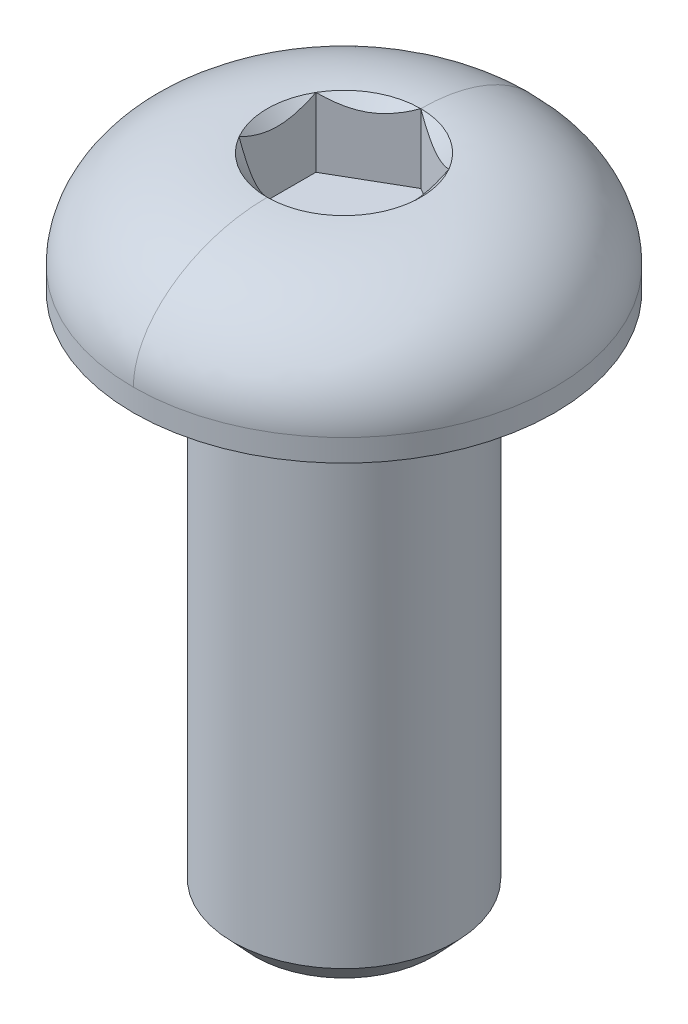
ISO-10303-21;
HEADER;
FILE_DESCRIPTION(('STEP AP214'),'2;1');
FILE_NAME('part.step','',(''),(''),'','','');
FILE_SCHEMA(('AUTOMOTIVE_DESIGN { 1 0 10303 214 1 1 1 1 }'));
ENDSEC;
DATA;
#1=APPLICATION_CONTEXT('core data for automotive mechanical design processes');
#2=APPLICATION_PROTOCOL_DEFINITION('international standard','automotive_design',2000,#1);
#3=PRODUCT_CONTEXT('',#1,'mechanical');
#4=PRODUCT('Part','Part','',(#3));
#5=PRODUCT_RELATED_PRODUCT_CATEGORY('part','',(#4));
#6=PRODUCT_DEFINITION_FORMATION('','',#4);
#7=PRODUCT_DEFINITION_CONTEXT('part definition',#1,'design');
#8=PRODUCT_DEFINITION('design','',#6,#7);
#9=PRODUCT_DEFINITION_SHAPE('','',#8);
#10=(LENGTH_UNIT() NAMED_UNIT(*) SI_UNIT(.MILLI.,.METRE.));
#11=(NAMED_UNIT(*) PLANE_ANGLE_UNIT() SI_UNIT($,.RADIAN.));
#12=(NAMED_UNIT(*) SI_UNIT($,.STERADIAN.) SOLID_ANGLE_UNIT());
#13=UNCERTAINTY_MEASURE_WITH_UNIT(LENGTH_MEASURE(1.E-05),#10,'distance_accuracy_value','');
#14=(GEOMETRIC_REPRESENTATION_CONTEXT(3) GLOBAL_UNCERTAINTY_ASSIGNED_CONTEXT((#13)) GLOBAL_UNIT_ASSIGNED_CONTEXT((#10,
#11,#12)) REPRESENTATION_CONTEXT('',''));
#15=CARTESIAN_POINT('',(0.,0.,0.));
#16=DIRECTION('',(0.,0.,1.));
#17=DIRECTION('',(1.,0.,0.));
#18=AXIS2_PLACEMENT_3D('',#15,#16,#17);
#19=CARTESIAN_POINT('',(0.,1.14,-1.73205080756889));
#20=DIRECTION('',(0.,1.,0.));
#21=DIRECTION('',(-1.,0.,0.));
#22=AXIS2_PLACEMENT_3D('',#19,#20,#21);
#23=PLANE('',#22);
#24=DIRECTION('',(0.866025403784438,0.,-0.500000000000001));
#25=VECTOR('',#24,1.);
#26=CARTESIAN_POINT('',(0.,1.14,1.73205080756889));
#27=LINE('',#26,#25);
#28=CARTESIAN_POINT('',(0.,1.14,1.73205080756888));
#29=VERTEX_POINT('',#28);
#30=CARTESIAN_POINT('',(1.5,1.14,0.866025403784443));
#31=VERTEX_POINT('',#30);
#32=EDGE_CURVE('E84',#29,#31,#27,.T.);
#33=ORIENTED_EDGE('',*,*,#32,.T.);
#34=DIRECTION('',(0.,0.,-1.));
#35=VECTOR('',#34,1.);
#36=CARTESIAN_POINT('',(1.5,1.14,0.866025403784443));
#37=LINE('',#36,#35);
#38=CARTESIAN_POINT('',(1.5,1.14,-0.866025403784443));
#39=VERTEX_POINT('',#38);
#40=EDGE_CURVE('E174',#31,#39,#37,.T.);
#41=ORIENTED_EDGE('',*,*,#40,.T.);
#42=DIRECTION('',(-0.866025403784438,0.,-0.500000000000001));
#43=VECTOR('',#42,1.);
#44=CARTESIAN_POINT('',(1.5,1.14,-0.866025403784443));
#45=LINE('',#44,#43);
#46=CARTESIAN_POINT('',(0.,1.14,-1.73205080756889));
#47=VERTEX_POINT('',#46);
#48=EDGE_CURVE('E169',#39,#47,#45,.T.);
#49=ORIENTED_EDGE('',*,*,#48,.T.);
#50=DIRECTION('',(-0.866025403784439,0.,0.5));
#51=VECTOR('',#50,1.);
#52=CARTESIAN_POINT('',(0.,1.14,-1.73205080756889));
#53=LINE('',#52,#51);
#54=CARTESIAN_POINT('',(-1.5,1.14,-0.866025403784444));
#55=VERTEX_POINT('',#54);
#56=EDGE_CURVE('E163',#47,#55,#53,.T.);
#57=ORIENTED_EDGE('',*,*,#56,.T.);
#58=DIRECTION('',(0.,0.,1.));
#59=VECTOR('',#58,1.);
#60=CARTESIAN_POINT('',(-1.5,1.14,-0.866025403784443));
#61=LINE('',#60,#59);
#62=CARTESIAN_POINT('',(-1.5,1.14,0.866025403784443));
#63=VERTEX_POINT('',#62);
#64=EDGE_CURVE('E157',#55,#63,#61,.T.);
#65=ORIENTED_EDGE('',*,*,#64,.T.);
#66=DIRECTION('',(0.866025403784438,0.,0.500000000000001));
#67=VECTOR('',#66,1.);
#68=CARTESIAN_POINT('',(-1.5,1.14,0.866025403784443));
#69=LINE('',#68,#67);
#70=EDGE_CURVE('E88',#63,#29,#69,.T.);
#71=ORIENTED_EDGE('',*,*,#70,.T.);
#72=EDGE_LOOP('',(#33,#41,#49,#57,#65,#71));
#73=FACE_BOUND('',#72,.T.);
#74=ADVANCED_FACE('F17',(#73),#23,.T.);
#75=CARTESIAN_POINT('',(0.,1.14,1.73205080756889));
#76=DIRECTION('',(0.500000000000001,0.,0.866025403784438));
#77=DIRECTION('',(0.866025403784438,0.,-0.500000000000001));
#78=AXIS2_PLACEMENT_3D('',#75,#76,#77);
#79=PLANE('',#78);
#80=CARTESIAN_POINT('',(4.40269606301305E-12,2.70000000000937,1.73205080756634));
#81=CARTESIAN_POINT('',(0.05155573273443,2.67026284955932,1.70228509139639));
#82=CARTESIAN_POINT('',(0.103973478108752,2.64227250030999,1.67202169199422));
#83=CARTESIAN_POINT('',(0.210858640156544,2.59102336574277,1.61031151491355));
#84=CARTESIAN_POINT('',(0.265336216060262,2.56779308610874,1.57885887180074));
#85=CARTESIAN_POINT('',(0.375187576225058,2.52799946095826,1.51543615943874));
#86=CARTESIAN_POINT('',(0.430533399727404,2.51133612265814,1.48348223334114));
#87=CARTESIAN_POINT('',(0.542443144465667,2.48566307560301,1.41887111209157));
#88=CARTESIAN_POINT('',(0.599003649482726,2.47663421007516,1.38621588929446));
#89=CARTESIAN_POINT('',(0.696490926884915,2.46848741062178,1.32993158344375));
#90=CARTESIAN_POINT('',(0.737291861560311,2.46728188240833,1.30637515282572));
#91=CARTESIAN_POINT('',(0.818821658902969,2.46931613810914,1.25930390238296));
#92=CARTESIAN_POINT('',(0.859550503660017,2.47255690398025,1.2357890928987));
#93=CARTESIAN_POINT('',(0.94061593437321,2.48329730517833,1.18898594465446));
#94=CARTESIAN_POINT('',(0.980952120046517,2.49080090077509,1.16569783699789));
#95=CARTESIAN_POINT('',(1.06094744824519,2.50965947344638,1.11951251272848));
#96=CARTESIAN_POINT('',(1.10060629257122,2.52101610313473,1.09661546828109));
#97=CARTESIAN_POINT('',(1.20214986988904,2.55471858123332,1.03798925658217));
#98=CARTESIAN_POINT('',(1.26340587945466,2.57960098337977,1.00262308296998));
#99=CARTESIAN_POINT('',(1.35347611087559,2.62160373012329,0.950621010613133));
#100=CARTESIAN_POINT('',(1.38315704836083,2.63636065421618,0.933484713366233));
#101=CARTESIAN_POINT('',(1.44197336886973,2.66722152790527,0.899527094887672));
#102=CARTESIAN_POINT('',(1.47110900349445,2.6833248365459,0.882705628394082));
#103=CARTESIAN_POINT('',(1.49999999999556,2.70000000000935,0.866025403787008));
#104=B_SPLINE_CURVE_WITH_KNOTS('',3,(#80,#81,#82,#83,#84,#85,#86,#87,#88,#89,#90,#91,#92,#93,
#94,#95,#96,#97,#98,#99,#100,#101,#102,#103),.UNSPECIFIED.,.F.,.F.,(4,2,2,2,2,2,2,2,2,2,2,4),
(0.,0.199774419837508,0.400712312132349,0.598459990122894,0.795709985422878,0.936894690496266,
1.07811058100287,1.2194578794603,1.3608658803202,1.58533909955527,1.69726364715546,
1.80913521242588),.UNSPECIFIED.);
#105=CARTESIAN_POINT('',(0.,2.70000000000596,1.73205080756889));
#106=VERTEX_POINT('',#105);
#107=CARTESIAN_POINT('',(1.5,2.70000000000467,0.86602540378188));
#108=VERTEX_POINT('',#107);
#109=EDGE_CURVE('E20',#106,#108,#104,.T.);
#110=ORIENTED_EDGE('',*,*,#109,.T.);
#111=DIRECTION('',(0.,1.,0.));
#112=VECTOR('',#111,1.);
#113=CARTESIAN_POINT('',(1.5,1.14,0.866025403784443));
#114=LINE('',#113,#112);
#115=EDGE_CURVE('E172',#108,#31,#114,.F.);
#116=ORIENTED_EDGE('',*,*,#115,.T.);
#117=ORIENTED_EDGE('',*,*,#32,.F.);
#118=DIRECTION('',(0.,1.,0.));
#119=VECTOR('',#118,1.);
#120=CARTESIAN_POINT('',(0.,1.14,1.73205080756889));
#121=LINE('',#120,#119);
#122=EDGE_CURVE('E78',#29,#106,#121,.T.);
#123=ORIENTED_EDGE('',*,*,#122,.T.);
#124=EDGE_LOOP('',(#110,#116,#117,#123));
#125=FACE_BOUND('',#124,.T.);
#126=ADVANCED_FACE('F80',(#125),#79,.F.);
#127=CARTESIAN_POINT('',(1.5,1.14,0.866025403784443));
#128=DIRECTION('',(1.,0.,0.));
#129=DIRECTION('',(0.,0.,-1.));
#130=AXIS2_PLACEMENT_3D('',#127,#128,#129);
#131=PLANE('',#130);
#132=CARTESIAN_POINT('',(1.5,2.70000000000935,0.866025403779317));
#133=CARTESIAN_POINT('',(1.5,2.67026284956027,0.806493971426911));
#134=CARTESIAN_POINT('',(1.5,2.64227250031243,0.745967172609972));
#135=CARTESIAN_POINT('',(1.5,2.59102336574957,0.622546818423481));
#136=CARTESIAN_POINT('',(1.5,2.56779308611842,0.559641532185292));
#137=CARTESIAN_POINT('',(1.5,2.52799946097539,0.432796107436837));
#138=CARTESIAN_POINT('',(1.5,2.5113361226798,0.368888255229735));
#139=CARTESIAN_POINT('',(1.5,2.4856630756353,0.239666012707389));
#140=CARTESIAN_POINT('',(1.5,2.47663421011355,0.174355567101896));
#141=CARTESIAN_POINT('',(1.5,2.46848741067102,0.0617869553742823));
#142=CARTESIAN_POINT('',(1.5,2.46728188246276,0.0146740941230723));
#143=CARTESIAN_POINT('',(1.5,2.46931613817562,-0.079468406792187));
#144=CARTESIAN_POINT('',(1.5,2.4725569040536,-0.126498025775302));
#145=CARTESIAN_POINT('',(1.5,2.48329730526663,-0.220104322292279));
#146=CARTESIAN_POINT('',(1.5,2.49080090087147,-0.266680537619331));
#147=CARTESIAN_POINT('',(1.5,2.50965947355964,-0.359051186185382));
#148=CARTESIAN_POINT('',(1.5,2.52101610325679,-0.404845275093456));
#149=CARTESIAN_POINT('',(1.5,2.55471858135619,-0.522097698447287));
#150=CARTESIAN_POINT('',(1.5,2.57960098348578,-0.59283004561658));
#151=CARTESIAN_POINT('',(1.5,2.62160373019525,-0.696834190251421));
#152=CARTESIAN_POINT('',(1.5,2.6363606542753,-0.731106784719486));
#153=CARTESIAN_POINT('',(1.5,2.66722152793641,-0.799022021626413));
#154=CARTESIAN_POINT('',(1.5,2.68332483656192,-0.83266495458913));
#155=CARTESIAN_POINT('',(1.5,2.70000000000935,-0.866025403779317));
#156=B_SPLINE_CURVE_WITH_KNOTS('',3,(#132,#133,#134,#135,#136,#137,#138,#139,#140,#141,#142,
#143,#144,#145,#146,#147,#148,#149,#150,#151,#152,#153,#154,#155),.UNSPECIFIED.,.F.,.F.,(4,2,2,
2,2,2,2,2,2,2,2,4),(0.,0.199774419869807,0.400712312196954,0.598459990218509,0.795709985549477,
0.936894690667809,1.07811058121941,1.21945787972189,1.36086588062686,1.58533909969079,
1.69726364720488,1.80913521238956),.UNSPECIFIED.);
#157=CARTESIAN_POINT('',(1.49999999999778,2.70000000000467,-0.866025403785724));
#158=VERTEX_POINT('',#157);
#159=EDGE_CURVE('E107',#108,#158,#156,.T.);
#160=ORIENTED_EDGE('',*,*,#159,.T.);
#161=DIRECTION('',(0.,1.,0.));
#162=VECTOR('',#161,1.);
#163=CARTESIAN_POINT('',(1.5,1.14,-0.866025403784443));
#164=LINE('',#163,#162);
#165=EDGE_CURVE('E166',#158,#39,#164,.F.);
#166=ORIENTED_EDGE('',*,*,#165,.T.);
#167=ORIENTED_EDGE('',*,*,#40,.F.);
#168=ORIENTED_EDGE('',*,*,#115,.F.);
#169=EDGE_LOOP('',(#160,#166,#167,#168));
#170=FACE_BOUND('',#169,.T.);
#171=ADVANCED_FACE('F253',(#170),#131,.F.);
#172=CARTESIAN_POINT('',(1.5,1.14,-0.866025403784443));
#173=DIRECTION('',(0.500000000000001,0.,-0.866025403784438));
#174=DIRECTION('',(-0.866025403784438,0.,-0.500000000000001));
#175=AXIS2_PLACEMENT_3D('',#172,#173,#174);
#176=PLANE('',#175);
#177=CARTESIAN_POINT('',(1.49999999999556,2.70000000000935,-0.866025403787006));
#178=CARTESIAN_POINT('',(1.44844426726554,2.6702628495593,-0.895791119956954));
#179=CARTESIAN_POINT('',(1.39602652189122,2.64227250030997,-0.926054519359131));
#180=CARTESIAN_POINT('',(1.28914135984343,2.59102336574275,-0.987764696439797));
#181=CARTESIAN_POINT('',(1.23466378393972,2.56779308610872,-1.01921733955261));
#182=CARTESIAN_POINT('',(1.12481242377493,2.52799946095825,-1.08264005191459));
#183=CARTESIAN_POINT('',(1.06946660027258,2.51133612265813,-1.11459397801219));
#184=CARTESIAN_POINT('',(0.957556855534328,2.48566307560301,-1.17920509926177));
#185=CARTESIAN_POINT('',(0.900996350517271,2.47663421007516,-1.21186032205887));
#186=CARTESIAN_POINT('',(0.803509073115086,2.46848741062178,-1.26814462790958));
#187=CARTESIAN_POINT('',(0.762708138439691,2.46728188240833,-1.29170105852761));
#188=CARTESIAN_POINT('',(0.681178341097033,2.46931613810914,-1.33877230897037));
#189=CARTESIAN_POINT('',(0.640449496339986,2.47255690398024,-1.36228711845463));
#190=CARTESIAN_POINT('',(0.559384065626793,2.48329730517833,-1.40909026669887));
#191=CARTESIAN_POINT('',(0.519047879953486,2.49080090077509,-1.43237837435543));
#192=CARTESIAN_POINT('',(0.439052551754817,2.50965947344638,-1.47856369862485));
#193=CARTESIAN_POINT('',(0.399393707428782,2.52101610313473,-1.50146074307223));
#194=CARTESIAN_POINT('',(0.297850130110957,2.55471858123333,-1.56008695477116));
#195=CARTESIAN_POINT('',(0.23659412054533,2.57960098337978,-1.59545312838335));
#196=CARTESIAN_POINT('',(0.146523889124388,2.6216037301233,-1.64745520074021));
#197=CARTESIAN_POINT('',(0.116842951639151,2.63636065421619,-1.66459149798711));
#198=CARTESIAN_POINT('',(0.0580266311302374,2.66722152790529,-1.69854911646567));
#199=CARTESIAN_POINT('',(0.0288909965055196,2.68332483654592,-1.71537058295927));
#200=CARTESIAN_POINT('',(4.40240045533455E-12,2.70000000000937,-1.73205080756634));
#201=B_SPLINE_CURVE_WITH_KNOTS('',3,(#177,#178,#179,#180,#181,#182,#183,#184,#185,#186,#187,
#188,#189,#190,#191,#192,#193,#194,#195,#196,#197,#198,#199,#200),.UNSPECIFIED.,.F.,.F.,(4,2,2,
2,2,2,2,2,2,2,2,4),(0.,0.199774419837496,0.400712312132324,0.598459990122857,0.79570998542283,
0.936894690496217,1.07811058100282,1.21945787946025,1.36086588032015,1.58533909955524,
1.69726364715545,1.80913521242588),.UNSPECIFIED.);
#202=CARTESIAN_POINT('',(0.,2.70000000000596,-1.73205080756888));
#203=VERTEX_POINT('',#202);
#204=EDGE_CURVE('E238',#158,#203,#201,.T.);
#205=ORIENTED_EDGE('',*,*,#204,.T.);
#206=DIRECTION('',(0.,1.,0.));
#207=VECTOR('',#206,1.);
#208=CARTESIAN_POINT('',(0.,1.14,-1.73205080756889));
#209=LINE('',#208,#207);
#210=EDGE_CURVE('E160',#203,#47,#209,.F.);
#211=ORIENTED_EDGE('',*,*,#210,.T.);
#212=ORIENTED_EDGE('',*,*,#48,.F.);
#213=ORIENTED_EDGE('',*,*,#165,.F.);
#214=EDGE_LOOP('',(#205,#211,#212,#213));
#215=FACE_BOUND('',#214,.T.);
#216=ADVANCED_FACE('F247',(#215),#176,.F.);
#217=CARTESIAN_POINT('',(0.,1.14,-1.73205080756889));
#218=DIRECTION('',(-0.5,0.,-0.866025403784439));
#219=DIRECTION('',(-0.866025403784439,0.,0.5));
#220=AXIS2_PLACEMENT_3D('',#217,#218,#219);
#221=PLANE('',#220);
#222=CARTESIAN_POINT('',(-4.40203525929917E-12,2.70000000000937,-1.73205080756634));
#223=CARTESIAN_POINT('',(-0.0515557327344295,2.67026284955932,-1.70228509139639));
#224=CARTESIAN_POINT('',(-0.103973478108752,2.64227250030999,-1.67202169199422));
#225=CARTESIAN_POINT('',(-0.210858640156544,2.59102336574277,-1.61031151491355));
#226=CARTESIAN_POINT('',(-0.265336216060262,2.56779308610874,-1.57885887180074));
#227=CARTESIAN_POINT('',(-0.375187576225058,2.52799946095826,-1.51543615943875));
#228=CARTESIAN_POINT('',(-0.430533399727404,2.51133612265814,-1.48348223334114));
#229=CARTESIAN_POINT('',(-0.542443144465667,2.48566307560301,-1.41887111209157));
#230=CARTESIAN_POINT('',(-0.599003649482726,2.47663421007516,-1.38621588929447));
#231=CARTESIAN_POINT('',(-0.696490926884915,2.46848741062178,-1.32993158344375));
#232=CARTESIAN_POINT('',(-0.737291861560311,2.46728188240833,-1.30637515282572));
#233=CARTESIAN_POINT('',(-0.818821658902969,2.46931613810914,-1.25930390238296));
#234=CARTESIAN_POINT('',(-0.859550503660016,2.47255690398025,-1.2357890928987));
#235=CARTESIAN_POINT('',(-0.94061593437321,2.48329730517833,-1.18898594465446));
#236=CARTESIAN_POINT('',(-0.980952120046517,2.49080090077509,-1.1656978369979));
#237=CARTESIAN_POINT('',(-1.06094744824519,2.50965947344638,-1.11951251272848));
#238=CARTESIAN_POINT('',(-1.10060629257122,2.52101610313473,-1.0966154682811));
#239=CARTESIAN_POINT('',(-1.20214986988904,2.55471858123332,-1.03798925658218));
#240=CARTESIAN_POINT('',(-1.26340587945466,2.57960098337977,-1.00262308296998));
#241=CARTESIAN_POINT('',(-1.35347611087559,2.62160373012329,-0.950621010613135));
#242=CARTESIAN_POINT('',(-1.38315704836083,2.63636065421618,-0.933484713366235));
#243=CARTESIAN_POINT('',(-1.44197336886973,2.66722152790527,-0.899527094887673));
#244=CARTESIAN_POINT('',(-1.47110900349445,2.6833248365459,-0.882705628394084));
#245=CARTESIAN_POINT('',(-1.49999999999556,2.70000000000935,-0.866025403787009));
#246=B_SPLINE_CURVE_WITH_KNOTS('',3,(#222,#223,#224,#225,#226,#227,#228,#229,#230,#231,#232,
#233,#234,#235,#236,#237,#238,#239,#240,#241,#242,#243,#244,#245),.UNSPECIFIED.,.F.,.F.,(4,2,2,
2,2,2,2,2,2,2,2,4),(0.,0.199774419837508,0.400712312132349,0.598459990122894,0.795709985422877,
0.936894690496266,1.07811058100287,1.2194578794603,1.3608658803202,1.58533909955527,
1.69726364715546,1.80913521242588),.UNSPECIFIED.);
#247=CARTESIAN_POINT('',(-1.5,2.70000000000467,-0.866025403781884));
#248=VERTEX_POINT('',#247);
#249=EDGE_CURVE('E232',#203,#248,#246,.T.);
#250=ORIENTED_EDGE('',*,*,#249,.T.);
#251=DIRECTION('',(0.,1.,0.));
#252=VECTOR('',#251,1.);
#253=CARTESIAN_POINT('',(-1.5,1.14,-0.866025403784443));
#254=LINE('',#253,#252);
#255=EDGE_CURVE('E154',#248,#55,#254,.F.);
#256=ORIENTED_EDGE('',*,*,#255,.T.);
#257=ORIENTED_EDGE('',*,*,#56,.F.);
#258=ORIENTED_EDGE('',*,*,#210,.F.);
#259=EDGE_LOOP('',(#250,#256,#257,#258));
#260=FACE_BOUND('',#259,.T.);
#261=ADVANCED_FACE('F243',(#260),#221,.F.);
#262=CARTESIAN_POINT('',(-1.5,1.14,-0.866025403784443));
#263=DIRECTION('',(-1.,0.,0.));
#264=DIRECTION('',(0.,0.,1.));
#265=AXIS2_PLACEMENT_3D('',#262,#263,#264);
#266=PLANE('',#265);
#267=CARTESIAN_POINT('',(-1.5,2.70000000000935,-0.866025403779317));
#268=CARTESIAN_POINT('',(-1.5,2.67026284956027,-0.806493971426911));
#269=CARTESIAN_POINT('',(-1.5,2.64227250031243,-0.745967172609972));
#270=CARTESIAN_POINT('',(-1.5,2.59102336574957,-0.62254681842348));
#271=CARTESIAN_POINT('',(-1.5,2.56779308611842,-0.559641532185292));
#272=CARTESIAN_POINT('',(-1.5,2.52799946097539,-0.432796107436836));
#273=CARTESIAN_POINT('',(-1.5,2.5113361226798,-0.368888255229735));
#274=CARTESIAN_POINT('',(-1.5,2.4856630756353,-0.239666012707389));
#275=CARTESIAN_POINT('',(-1.5,2.47663421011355,-0.174355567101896));
#276=CARTESIAN_POINT('',(-1.5,2.46848741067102,-0.0617869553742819));
#277=CARTESIAN_POINT('',(-1.5,2.46728188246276,-0.0146740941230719));
#278=CARTESIAN_POINT('',(-1.5,2.46931613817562,0.0794684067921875));
#279=CARTESIAN_POINT('',(-1.5,2.4725569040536,0.126498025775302));
#280=CARTESIAN_POINT('',(-1.5,2.48329730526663,0.220104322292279));
#281=CARTESIAN_POINT('',(-1.5,2.49080090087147,0.266680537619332));
#282=CARTESIAN_POINT('',(-1.5,2.50965947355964,0.359051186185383));
#283=CARTESIAN_POINT('',(-1.5,2.52101610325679,0.404845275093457));
#284=CARTESIAN_POINT('',(-1.5,2.55471858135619,0.522097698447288));
#285=CARTESIAN_POINT('',(-1.5,2.57960098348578,0.59283004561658));
#286=CARTESIAN_POINT('',(-1.5,2.62160373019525,0.696834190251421));
#287=CARTESIAN_POINT('',(-1.5,2.6363606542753,0.731106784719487));
#288=CARTESIAN_POINT('',(-1.5,2.66722152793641,0.799022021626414));
#289=CARTESIAN_POINT('',(-1.5,2.68332483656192,0.83266495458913));
#290=CARTESIAN_POINT('',(-1.5,2.70000000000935,0.866025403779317));
#291=B_SPLINE_CURVE_WITH_KNOTS('',3,(#267,#268,#269,#270,#271,#272,#273,#274,#275,#276,#277,
#278,#279,#280,#281,#282,#283,#284,#285,#286,#287,#288,#289,#290),.UNSPECIFIED.,.F.,.F.,(4,2,2,
2,2,2,2,2,2,2,2,4),(0.,0.199774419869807,0.400712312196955,0.59845999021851,0.795709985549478,
0.93689469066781,1.07811058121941,1.2194578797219,1.36086588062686,1.58533909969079,
1.69726364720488,1.80913521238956),.UNSPECIFIED.);
#292=CARTESIAN_POINT('',(-1.49999999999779,2.70000000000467,0.866025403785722));
#293=VERTEX_POINT('',#292);
#294=EDGE_CURVE('E100',#248,#293,#291,.T.);
#295=ORIENTED_EDGE('',*,*,#294,.T.);
#296=DIRECTION('',(0.,1.,0.));
#297=VECTOR('',#296,1.);
#298=CARTESIAN_POINT('',(-1.5,1.14,0.866025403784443));
#299=LINE('',#298,#297);
#300=EDGE_CURVE('E87',#293,#63,#299,.F.);
#301=ORIENTED_EDGE('',*,*,#300,.T.);
#302=ORIENTED_EDGE('',*,*,#64,.F.);
#303=ORIENTED_EDGE('',*,*,#255,.F.);
#304=EDGE_LOOP('',(#295,#301,#302,#303));
#305=FACE_BOUND('',#304,.T.);
#306=ADVANCED_FACE('F246',(#305),#266,.F.);
#307=CARTESIAN_POINT('',(-1.5,1.14,0.866025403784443));
#308=DIRECTION('',(-0.500000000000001,0.,0.866025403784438));
#309=DIRECTION('',(0.866025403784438,0.,0.500000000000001));
#310=AXIS2_PLACEMENT_3D('',#307,#308,#309);
#311=PLANE('',#310);
#312=CARTESIAN_POINT('',(-1.49999999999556,2.70000000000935,0.866025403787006));
#313=CARTESIAN_POINT('',(-1.44844426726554,2.6702628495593,0.895791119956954));
#314=CARTESIAN_POINT('',(-1.39602652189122,2.64227250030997,0.926054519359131));
#315=CARTESIAN_POINT('',(-1.28914135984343,2.59102336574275,0.987764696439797));
#316=CARTESIAN_POINT('',(-1.23466378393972,2.56779308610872,1.01921733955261));
#317=CARTESIAN_POINT('',(-1.12481242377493,2.52799946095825,1.08264005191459));
#318=CARTESIAN_POINT('',(-1.06946660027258,2.51133612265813,1.11459397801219));
#319=CARTESIAN_POINT('',(-0.957556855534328,2.48566307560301,1.17920509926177));
#320=CARTESIAN_POINT('',(-0.900996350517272,2.47663421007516,1.21186032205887));
#321=CARTESIAN_POINT('',(-0.803509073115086,2.46848741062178,1.26814462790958));
#322=CARTESIAN_POINT('',(-0.762708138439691,2.46728188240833,1.29170105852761));
#323=CARTESIAN_POINT('',(-0.681178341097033,2.46931613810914,1.33877230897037));
#324=CARTESIAN_POINT('',(-0.640449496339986,2.47255690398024,1.36228711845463));
#325=CARTESIAN_POINT('',(-0.559384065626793,2.48329730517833,1.40909026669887));
#326=CARTESIAN_POINT('',(-0.519047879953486,2.49080090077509,1.43237837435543));
#327=CARTESIAN_POINT('',(-0.439052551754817,2.50965947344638,1.47856369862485));
#328=CARTESIAN_POINT('',(-0.399393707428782,2.52101610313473,1.50146074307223));
#329=CARTESIAN_POINT('',(-0.297850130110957,2.55471858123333,1.56008695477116));
#330=CARTESIAN_POINT('',(-0.23659412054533,2.57960098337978,1.59545312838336));
#331=CARTESIAN_POINT('',(-0.146523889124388,2.6216037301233,1.64745520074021));
#332=CARTESIAN_POINT('',(-0.116842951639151,2.63636065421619,1.66459149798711));
#333=CARTESIAN_POINT('',(-0.0580266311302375,2.66722152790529,1.69854911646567));
#334=CARTESIAN_POINT('',(-0.0288909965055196,2.68332483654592,1.71537058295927));
#335=CARTESIAN_POINT('',(-4.40227938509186E-12,2.70000000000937,1.73205080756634));
#336=B_SPLINE_CURVE_WITH_KNOTS('',3,(#312,#313,#314,#315,#316,#317,#318,#319,#320,#321,#322,
#323,#324,#325,#326,#327,#328,#329,#330,#331,#332,#333,#334,#335),.UNSPECIFIED.,.F.,.F.,(4,2,2,
2,2,2,2,2,2,2,2,4),(0.,0.199774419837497,0.400712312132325,0.598459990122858,0.79570998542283,
0.936894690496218,1.07811058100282,1.21945787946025,1.36086588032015,1.58533909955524,
1.69726364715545,1.80913521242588),.UNSPECIFIED.);
#337=EDGE_CURVE('E92',#293,#106,#336,.T.);
#338=ORIENTED_EDGE('',*,*,#337,.T.);
#339=ORIENTED_EDGE('',*,*,#122,.F.);
#340=ORIENTED_EDGE('',*,*,#70,.F.);
#341=ORIENTED_EDGE('',*,*,#300,.F.);
#342=EDGE_LOOP('',(#338,#339,#340,#341));
#343=FACE_BOUND('',#342,.T.);
#344=ADVANCED_FACE('F93',(#343),#311,.F.);
#345=CARTESIAN_POINT('',(0.,2.70000000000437,0.));
#346=DIRECTION('',(0.,1.,0.));
#347=DIRECTION('',(0.,0.,1.));
#348=AXIS2_PLACEMENT_3D('',#345,#346,#347);
#349=CONICAL_SURFACE('',#348,1.73205080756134,0.785398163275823);
#350=ORIENTED_EDGE('',*,*,#109,.F.);
#351=CARTESIAN_POINT('',(0.,2.7,0.));
#352=DIRECTION('',(0.,1.,0.));
#353=DIRECTION('',(-1.,0.,0.));
#354=AXIS2_PLACEMENT_3D('',#351,#352,#353);
#355=CIRCLE('',#354,1.73205080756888);
#356=EDGE_CURVE('E99',#106,#108,#355,.T.);
#357=ORIENTED_EDGE('',*,*,#356,.T.);
#358=EDGE_LOOP('',(#350,#357));
#359=FACE_BOUND('',#358,.T.);
#360=ADVANCED_FACE('F104',(#359),#349,.F.);
#361=CARTESIAN_POINT('',(0.,2.70000000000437,0.));
#362=DIRECTION('',(0.,1.,0.));
#363=DIRECTION('',(0.,0.,1.));
#364=AXIS2_PLACEMENT_3D('',#361,#362,#363);
#365=CONICAL_SURFACE('',#364,1.73205080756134,0.785398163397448);
#366=CARTESIAN_POINT('',(0.,2.7,0.));
#367=DIRECTION('',(0.,1.,0.));
#368=DIRECTION('',(-1.,0.,0.));
#369=AXIS2_PLACEMENT_3D('',#366,#367,#368);
#370=CIRCLE('',#369,1.73205080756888);
#371=EDGE_CURVE('E120',#108,#158,#370,.T.);
#372=ORIENTED_EDGE('',*,*,#371,.T.);
#373=ORIENTED_EDGE('',*,*,#159,.F.);
#374=EDGE_LOOP('',(#372,#373));
#375=FACE_BOUND('',#374,.T.);
#376=ADVANCED_FACE('F262',(#375),#365,.F.);
#377=CARTESIAN_POINT('',(0.,2.70000000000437,0.));
#378=DIRECTION('',(0.,1.,0.));
#379=DIRECTION('',(0.,0.,1.));
#380=AXIS2_PLACEMENT_3D('',#377,#378,#379);
#381=CONICAL_SURFACE('',#380,1.73205080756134,0.785398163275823);
#382=CARTESIAN_POINT('',(0.,2.7,0.));
#383=DIRECTION('',(0.,1.,0.));
#384=DIRECTION('',(-1.,0.,0.));
#385=AXIS2_PLACEMENT_3D('',#382,#383,#384);
#386=CIRCLE('',#385,1.73205080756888);
#387=EDGE_CURVE('E138',#158,#203,#386,.T.);
#388=ORIENTED_EDGE('',*,*,#387,.T.);
#389=ORIENTED_EDGE('',*,*,#204,.F.);
#390=EDGE_LOOP('',(#388,#389));
#391=FACE_BOUND('',#390,.T.);
#392=ADVANCED_FACE('F228',(#391),#381,.F.);
#393=CARTESIAN_POINT('',(0.,2.70000000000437,0.));
#394=DIRECTION('',(0.,1.,0.));
#395=DIRECTION('',(0.,0.,1.));
#396=AXIS2_PLACEMENT_3D('',#393,#394,#395);
#397=CONICAL_SURFACE('',#396,1.73205080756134,0.785398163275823);
#398=ORIENTED_EDGE('',*,*,#249,.F.);
#399=CARTESIAN_POINT('',(0.,2.7,0.));
#400=DIRECTION('',(0.,1.,0.));
#401=DIRECTION('',(0.,0.,1.));
#402=AXIS2_PLACEMENT_3D('',#399,#400,#401);
#403=CIRCLE('',#402,1.73205080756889);
#404=EDGE_CURVE('E144',#203,#248,#403,.T.);
#405=ORIENTED_EDGE('',*,*,#404,.T.);
#406=EDGE_LOOP('',(#398,#405));
#407=FACE_BOUND('',#406,.T.);
#408=ADVANCED_FACE('F223',(#407),#397,.F.);
#409=CARTESIAN_POINT('',(0.,2.70000000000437,0.));
#410=DIRECTION('',(0.,1.,0.));
#411=DIRECTION('',(0.,0.,1.));
#412=AXIS2_PLACEMENT_3D('',#409,#410,#411);
#413=CONICAL_SURFACE('',#412,1.73205080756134,0.785398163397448);
#414=ORIENTED_EDGE('',*,*,#294,.F.);
#415=CARTESIAN_POINT('',(0.,2.7,0.));
#416=DIRECTION('',(0.,1.,0.));
#417=DIRECTION('',(0.,0.,1.));
#418=AXIS2_PLACEMENT_3D('',#415,#416,#417);
#419=CIRCLE('',#418,1.73205080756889);
#420=EDGE_CURVE('E114',#248,#293,#419,.T.);
#421=ORIENTED_EDGE('',*,*,#420,.T.);
#422=EDGE_LOOP('',(#414,#421));
#423=FACE_BOUND('',#422,.T.);
#424=ADVANCED_FACE('F216',(#423),#413,.F.);
#425=CARTESIAN_POINT('',(0.,2.70000000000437,0.));
#426=DIRECTION('',(0.,1.,0.));
#427=DIRECTION('',(0.,0.,1.));
#428=AXIS2_PLACEMENT_3D('',#425,#426,#427);
#429=CONICAL_SURFACE('',#428,1.73205080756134,0.785398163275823);
#430=ORIENTED_EDGE('',*,*,#337,.F.);
#431=CARTESIAN_POINT('',(0.,2.7,0.));
#432=DIRECTION('',(0.,1.,0.));
#433=DIRECTION('',(0.,0.,1.));
#434=AXIS2_PLACEMENT_3D('',#431,#432,#433);
#435=CIRCLE('',#434,1.73205080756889);
#436=EDGE_CURVE('E108',#293,#106,#435,.T.);
#437=ORIENTED_EDGE('',*,*,#436,.T.);
#438=EDGE_LOOP('',(#430,#437));
#439=FACE_BOUND('',#438,.T.);
#440=ADVANCED_FACE('F109',(#439),#429,.F.);
#441=CARTESIAN_POINT('',(0.,0.5,4.75000000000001));
#442=CARTESIAN_POINT('',(9.50000000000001,0.5,4.75000000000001));
#443=CARTESIAN_POINT('',(9.50000000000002,0.500000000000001,-4.75000000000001));
#444=CARTESIAN_POINT('',(0.,0.500000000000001,-4.75000000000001));
#445=CARTESIAN_POINT('',(0.,1.78873016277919,4.75000000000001));
#446=CARTESIAN_POINT('',(9.50000000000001,1.78873016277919,4.75000000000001));
#447=CARTESIAN_POINT('',(9.50000000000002,1.78873016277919,-4.75000000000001));
#448=CARTESIAN_POINT('',(0.,1.78873016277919,-4.75000000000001));
#449=CARTESIAN_POINT('',(0.,2.7,3.4999245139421));
#450=CARTESIAN_POINT('',(6.99984902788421,2.7,3.4999245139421));
#451=CARTESIAN_POINT('',(6.99984902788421,2.7,-3.4999245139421));
#452=CARTESIAN_POINT('',(0.,2.7,-3.4999245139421));
#453=CARTESIAN_POINT('',(0.,2.7,1.73205080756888));
#454=CARTESIAN_POINT('',(3.46410161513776,2.7,1.73205080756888));
#455=CARTESIAN_POINT('',(3.46410161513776,2.7,-1.73205080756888));
#456=CARTESIAN_POINT('',(0.,2.7,-1.73205080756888));
#457=(BOUNDED_SURFACE() B_SPLINE_SURFACE(3,3,((#441,#442,#443,#444),(#445,#446,#447,#448),(#449,
#450,#451,#452),(#453,#454,#455,#456)),.UNSPECIFIED.,.F.,.F.,
.F.) B_SPLINE_SURFACE_WITH_KNOTS((4,4),(4,4),(0.,1.),(0.,1.),
.UNSPECIFIED.) GEOMETRIC_REPRESENTATION_ITEM() RATIONAL_B_SPLINE_SURFACE(((1.,0.333333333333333,
0.333333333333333,1.),(0.804737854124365,0.268245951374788,0.268245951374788,0.804737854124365),
(0.804737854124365,0.268245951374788,0.268245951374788,0.804737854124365),(1.,0.333333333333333,
0.333333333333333,1.))) REPRESENTATION_ITEM('') SURFACE());
#458=CARTESIAN_POINT('',(0.,0.500000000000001,-4.75000000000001));
#459=CARTESIAN_POINT('',(0.,1.78873016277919,-4.75000000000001));
#460=CARTESIAN_POINT('',(0.,2.7,-3.49992451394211));
#461=CARTESIAN_POINT('',(0.,2.7,-1.73205080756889));
#462=(BOUNDED_CURVE() B_SPLINE_CURVE(3,(#458,#459,#460,#461),.UNSPECIFIED.,.F.,
.F.) B_SPLINE_CURVE_WITH_KNOTS((4,4),(0.,1.),
.UNSPECIFIED.) CURVE() GEOMETRIC_REPRESENTATION_ITEM() RATIONAL_B_SPLINE_CURVE((1.,
0.804737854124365,0.804737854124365,1.)) REPRESENTATION_ITEM(''));
#463=CARTESIAN_POINT('',(0.,0.500000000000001,-4.75));
#464=VERTEX_POINT('',#463);
#465=EDGE_CURVE('E126',#464,#203,#462,.T.);
#466=CARTESIAN_POINT('',(0.,0.5,4.75000000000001));
#467=CARTESIAN_POINT('',(0.,1.78873016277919,4.75000000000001));
#468=CARTESIAN_POINT('',(0.,2.7,3.49992451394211));
#469=CARTESIAN_POINT('',(0.,2.7,1.73205080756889));
#470=(BOUNDED_CURVE() B_SPLINE_CURVE(3,(#466,#467,#468,#469),.UNSPECIFIED.,.F.,
.F.) B_SPLINE_CURVE_WITH_KNOTS((4,4),(0.,1.),
.UNSPECIFIED.) CURVE() GEOMETRIC_REPRESENTATION_ITEM() RATIONAL_B_SPLINE_CURVE((1.,
0.804737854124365,0.804737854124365,1.)) REPRESENTATION_ITEM(''));
#471=CARTESIAN_POINT('',(0.,0.5,4.75));
#472=VERTEX_POINT('',#471);
#473=EDGE_CURVE('E113',#106,#472,#470,.F.);
#474=CARTESIAN_POINT('',(0.,0.500000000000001,0.));
#475=DIRECTION('',(0.,-1.,0.));
#476=DIRECTION('',(0.,0.,-1.));
#477=AXIS2_PLACEMENT_3D('',#474,#475,#476);
#478=CIRCLE('',#477,4.75);
#479=EDGE_CURVE('E39',#464,#472,#478,.T.);
#480=ORIENTED_EDGE('',*,*,#465,.T.);
#481=ORIENTED_EDGE('',*,*,#387,.F.);
#482=ORIENTED_EDGE('',*,*,#371,.F.);
#483=ORIENTED_EDGE('',*,*,#356,.F.);
#484=ORIENTED_EDGE('',*,*,#473,.T.);
#485=ORIENTED_EDGE('',*,*,#479,.F.);
#486=EDGE_LOOP('',(#480,#481,#482,#483,#484,#485));
#487=FACE_BOUND('',#486,.T.);
#488=ADVANCED_FACE('F117',(#487),#457,.F.);
#489=CARTESIAN_POINT('',(0.,0.500000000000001,-4.75000000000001));
#490=CARTESIAN_POINT('',(-9.50000000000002,0.500000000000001,-4.75000000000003));
#491=CARTESIAN_POINT('',(-9.50000000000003,0.5,4.75));
#492=CARTESIAN_POINT('',(0.,0.5,4.75000000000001));
#493=CARTESIAN_POINT('',(0.,1.78873016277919,-4.75000000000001));
#494=CARTESIAN_POINT('',(-9.50000000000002,1.78873016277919,-4.75000000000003));
#495=CARTESIAN_POINT('',(-9.50000000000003,1.78873016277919,4.75));
#496=CARTESIAN_POINT('',(0.,1.78873016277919,4.75000000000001));
#497=CARTESIAN_POINT('',(0.,2.7,-3.49992451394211));
#498=CARTESIAN_POINT('',(-6.99984902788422,2.7,-3.49992451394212));
#499=CARTESIAN_POINT('',(-6.99984902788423,2.7,3.49992451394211));
#500=CARTESIAN_POINT('',(0.,2.7,3.49992451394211));
#501=CARTESIAN_POINT('',(0.,2.7,-1.73205080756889));
#502=CARTESIAN_POINT('',(-3.46410161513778,2.7,-1.73205080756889));
#503=CARTESIAN_POINT('',(-3.46410161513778,2.7,1.73205080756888));
#504=CARTESIAN_POINT('',(0.,2.7,1.73205080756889));
#505=(BOUNDED_SURFACE() B_SPLINE_SURFACE(3,3,((#489,#490,#491,#492),(#493,#494,#495,#496),(#497,
#498,#499,#500),(#501,#502,#503,#504)),.UNSPECIFIED.,.F.,.F.,
.F.) B_SPLINE_SURFACE_WITH_KNOTS((4,4),(4,4),(0.,1.),(0.,1.),
.UNSPECIFIED.) GEOMETRIC_REPRESENTATION_ITEM() RATIONAL_B_SPLINE_SURFACE(((1.,0.333333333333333,
0.333333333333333,1.),(0.804737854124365,0.268245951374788,0.268245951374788,0.804737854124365),
(0.804737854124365,0.268245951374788,0.268245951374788,0.804737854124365),(1.,0.333333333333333,
0.333333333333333,1.))) REPRESENTATION_ITEM('') SURFACE());
#506=CARTESIAN_POINT('',(0.,0.5,0.));
#507=DIRECTION('',(0.,-1.,0.));
#508=DIRECTION('',(0.,0.,-1.));
#509=AXIS2_PLACEMENT_3D('',#506,#507,#508);
#510=CIRCLE('',#509,4.75);
#511=EDGE_CURVE('E125',#472,#464,#510,.T.);
#512=ORIENTED_EDGE('',*,*,#511,.F.);
#513=ORIENTED_EDGE('',*,*,#473,.F.);
#514=ORIENTED_EDGE('',*,*,#436,.F.);
#515=ORIENTED_EDGE('',*,*,#420,.F.);
#516=ORIENTED_EDGE('',*,*,#404,.F.);
#517=ORIENTED_EDGE('',*,*,#465,.F.);
#518=EDGE_LOOP('',(#512,#513,#514,#515,#516,#517));
#519=FACE_BOUND('',#518,.T.);
#520=ADVANCED_FACE('F123',(#519),#505,.F.);
#521=CARTESIAN_POINT('',(0.,-12.,0.));
#522=DIRECTION('',(0.,1.,0.));
#523=DIRECTION('',(-1.,0.,0.));
#524=AXIS2_PLACEMENT_3D('',#521,#522,#523);
#525=PLANE('',#524);
#526=CARTESIAN_POINT('',(0.,-11.9999999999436,0.));
#527=DIRECTION('',(0.,1.,0.));
#528=DIRECTION('',(0.,0.,1.));
#529=AXIS2_PLACEMENT_3D('',#526,#527,#528);
#530=CIRCLE('',#529,2.00000000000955);
#531=CARTESIAN_POINT('',(0.,-11.9999999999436,2.00000000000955));
#532=VERTEX_POINT('',#531);
#533=EDGE_CURVE('E198',#532,#532,#530,.T.);
#534=ORIENTED_EDGE('',*,*,#533,.F.);
#535=EDGE_LOOP('',(#534));
#536=FACE_BOUND('',#535,.T.);
#537=ADVANCED_FACE('F291',(#536),#525,.F.);
#538=CARTESIAN_POINT('',(0.,2.70000000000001,0.));
#539=DIRECTION('',(0.,-1.,0.));
#540=DIRECTION('',(0.,0.,-1.));
#541=AXIS2_PLACEMENT_3D('',#538,#539,#540);
#542=CYLINDRICAL_SURFACE('',#541,4.75);
#543=ORIENTED_EDGE('',*,*,#479,.T.);
#544=ORIENTED_EDGE('',*,*,#511,.T.);
#545=EDGE_LOOP('',(#543,#544));
#546=FACE_BOUND('',#545,.T.);
#547=CARTESIAN_POINT('',(0.,0.,0.));
#548=DIRECTION('',(0.,-1.,0.));
#549=DIRECTION('',(0.,0.,-1.));
#550=AXIS2_PLACEMENT_3D('',#547,#548,#549);
#551=CIRCLE('',#550,4.75);
#552=CARTESIAN_POINT('',(0.,0.,-4.75));
#553=VERTEX_POINT('',#552);
#554=EDGE_CURVE('E195',#553,#553,#551,.F.);
#555=ORIENTED_EDGE('',*,*,#554,.T.);
#556=EDGE_LOOP('',(#555));
#557=FACE_BOUND('',#556,.T.);
#558=ADVANCED_FACE('F287',(#546,#557),#542,.T.);
#559=CARTESIAN_POINT('',(0.,-11.4638156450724,0.));
#560=DIRECTION('',(0.,1.,0.));
#561=DIRECTION('',(0.,0.,1.));
#562=AXIS2_PLACEMENT_3D('',#559,#560,#561);
#563=CONICAL_SURFACE('',#562,2.49999999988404,0.750491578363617);
#564=CARTESIAN_POINT('',(0.,-11.4638156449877,0.));
#565=DIRECTION('',(0.,1.,0.));
#566=DIRECTION('',(-1.,0.,0.));
#567=AXIS2_PLACEMENT_3D('',#564,#565,#566);
#568=CIRCLE('',#567,2.5);
#569=CARTESIAN_POINT('',(-2.5,-11.4638156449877,0.));
#570=VERTEX_POINT('',#569);
#571=EDGE_CURVE('E30',#570,#570,#568,.T.);
#572=ORIENTED_EDGE('',*,*,#571,.F.);
#573=EDGE_LOOP('',(#572));
#574=FACE_BOUND('',#573,.T.);
#575=ORIENTED_EDGE('',*,*,#533,.T.);
#576=EDGE_LOOP('',(#575));
#577=FACE_BOUND('',#576,.T.);
#578=ADVANCED_FACE('F280',(#574,#577),#563,.T.);
#579=CARTESIAN_POINT('',(0.,0.,0.));
#580=DIRECTION('',(0.,1.,0.));
#581=DIRECTION('',(-1.,0.,0.));
#582=AXIS2_PLACEMENT_3D('',#579,#580,#581);
#583=PLANE('',#582);
#584=ORIENTED_EDGE('',*,*,#554,.F.);
#585=EDGE_LOOP('',(#584));
#586=FACE_BOUND('',#585,.T.);
#587=CARTESIAN_POINT('',(0.,0.,0.));
#588=DIRECTION('',(0.,1.,0.));
#589=DIRECTION('',(-1.,0.,0.));
#590=AXIS2_PLACEMENT_3D('',#587,#588,#589);
#591=CIRCLE('',#590,2.5);
#592=CARTESIAN_POINT('',(-2.5,0.,0.));
#593=VERTEX_POINT('',#592);
#594=EDGE_CURVE('E11',#593,#593,#591,.F.);
#595=ORIENTED_EDGE('',*,*,#594,.F.);
#596=EDGE_LOOP('',(#595));
#597=FACE_BOUND('',#596,.T.);
#598=ADVANCED_FACE('F274',(#586,#597),#583,.F.);
#599=CARTESIAN_POINT('',(0.,-12.,0.));
#600=DIRECTION('',(0.,1.,0.));
#601=DIRECTION('',(-1.,0.,0.));
#602=AXIS2_PLACEMENT_3D('',#599,#600,#601);
#603=CYLINDRICAL_SURFACE('',#602,2.5);
#604=ORIENTED_EDGE('',*,*,#594,.T.);
#605=EDGE_LOOP('',(#604));
#606=FACE_BOUND('',#605,.T.);
#607=ORIENTED_EDGE('',*,*,#571,.T.);
#608=EDGE_LOOP('',(#607));
#609=FACE_BOUND('',#608,.T.);
#610=ADVANCED_FACE('F272',(#606,#609),#603,.T.);
#611=CLOSED_SHELL('',(#74,#126,#171,#216,#261,#306,#344,#360,#376,#392,#408,#424,#440,#488,#520,
#537,#558,#578,#598,#610));
#612=MANIFOLD_SOLID_BREP('B1',#611);
#613=ADVANCED_BREP_SHAPE_REPRESENTATION('',(#18,#612),#14);
#614=SHAPE_DEFINITION_REPRESENTATION(#9,#613);
ENDSEC;
END-ISO-10303-21;
